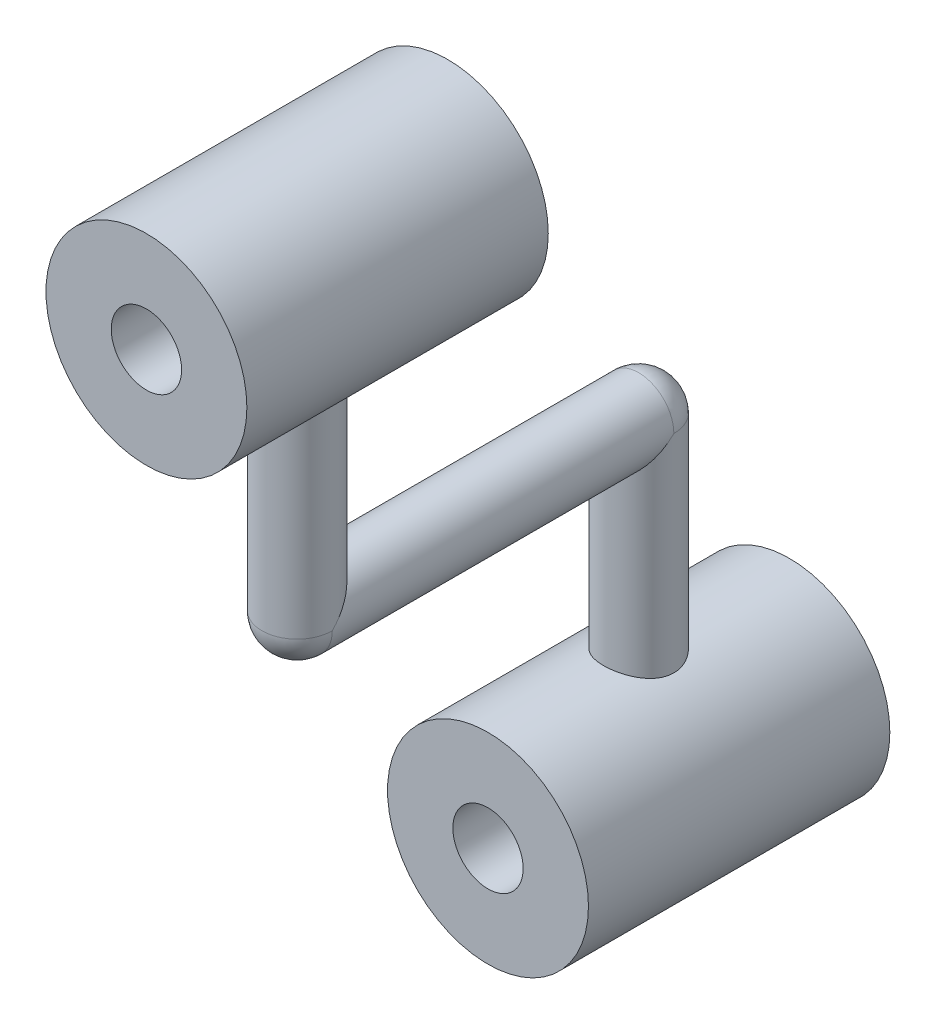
from build123d import *

# Parameters (mm, degrees)
EXTRUSION1_DEPTH        = 15
EXTRUSION1_DEPTH_BACK   = 15
ESQUISSE1_R             = 10
ESQUISSE1_R_2           = 3.5
ESQUISSE2_R             = 3.5
EXTRUSION2_DEPTH        = 30
ESQUISSE6_R             = 3.5
EXTRUSION4_DEPTH        = 34
ESQUISSE7_W             = 3.5
ESQUISSE7_H             = 30
ESQUISSE8_W             = 30
ESQUISSE8_H             = 10
ESQUISSE9_R             = 3.5
ENL_V_MAT_EXTRU_3_DEPTH = 35
ESQUISSE10_R            = 3.5
ENL_V_MAT_EXTRU_4_DEPTH = 35


with BuildPart() as part:
    # Esquisse1 → Extrusion1 (new, two sides: drawn at the far end of the back side and taken through both)
    with BuildSketch(Plane.XY.offset(-EXTRUSION1_DEPTH_BACK)):
        Circle(ESQUISSE1_R)
        Circle(ESQUISSE1_R_2, mode=Mode.SUBTRACT)
    extrude(amount=EXTRUSION1_DEPTH + EXTRUSION1_DEPTH_BACK)

    # Esquisse2 → Extrusion2 (add)
    with BuildSketch(Plane(origin=(0, 0, 0), x_dir=(1, 0, 0), z_dir=(0, 1, 0))):
        with Locations(Location((0, 0, 0), (0, 0, 90))):
            Circle(ESQUISSE2_R)
    extrude(amount=EXTRUSION2_DEPTH)

    # Esquisse6 → Extrusion4 (add)
    with BuildSketch(Plane.XY):
        with Locations((0, 30)):
            Circle(ESQUISSE6_R)
    extrude(amount=EXTRUSION4_DEPTH)

    # Esquisse7 → R_volution1 (revolve)
    with BuildSketch(Plane(origin=(0, 0, 0), x_dir=(0, 0, -1), z_dir=(1, 0, 0)), mode=Mode.PRIVATE) as r_volution1_sk:
        with Locations((-35.75, 45)):
            Rectangle(ESQUISSE7_W, ESQUISSE7_H)
    revolve(r_volution1_sk.sketch.rotate(Axis((0, 26.5, 34), (0, 1, 0)), 180), axis=Axis((0, 26.5, 34), (0, 1, 0)))

    # Esquisse8 → R_volution2 (revolve)
    with BuildSketch(Plane(origin=(0, 0, 0), x_dir=(0, 0, -1), z_dir=(1, 0, 0)), mode=Mode.PRIVATE) as r_volution2_sk:
        with Locations((-34, 55)):
            Rectangle(ESQUISSE8_W, ESQUISSE8_H)
    revolve(r_volution2_sk.sketch.rotate(Axis((0, 60, 64.40702134), (0, 0, -1)), 270), axis=Axis((0, 60, 64.40702134), (0, 0, -1)))

    # Esquisse9 → Enl_v. mat.-Extru.3 (cut)
    with BuildSketch(Plane(origin=(0, 0, 19), x_dir=(-1, 0, 0), z_dir=(0, 0, -1))):
        with Locations((0, 60)):
            Circle(ESQUISSE9_R)
    extrude(amount=-ENL_V_MAT_EXTRU_3_DEPTH, mode=Mode.SUBTRACT)

    # Esquisse10 → Enl_v. mat.-Extru.4 (cut)
    with BuildSketch(Plane(origin=(0, 0, -15), x_dir=(-1, 0, 0), z_dir=(0, 0, -1))):
        with Locations(Location((0, 0, 0), (0, 0, 180))):
            Circle(ESQUISSE10_R)
    extrude(amount=-ENL_V_MAT_EXTRU_4_DEPTH, mode=Mode.SUBTRACT)

    # Esquisse11 → R_volution3 (revolve)
    with BuildSketch(Plane(origin=(0, 0, 0), x_dir=(-1, 0, 0), z_dir=(0, 0, -1))):
        with BuildLine():
            Line((-3.5, 30), (3.5, 30))
            ThreePointArc((3.5, 30), (0, 33.5), (-3.5, 30))
        make_face()
    revolve(axis=Axis((8.612907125, 30, 0), (-1, 0, 0)))

    # Esquisse12 → R_volution4 (revolve)
    with BuildSketch(Plane.XY.offset(34)):
        with BuildLine():
            Line((3.5, 30), (-3.5, 30))
            ThreePointArc((-3.5, 30), (0, 26.5), (3.5, 30))
        make_face()
    revolve(axis=Axis((-10.502004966, 30, 34), (1, 0, 0)))


solid = part.part
